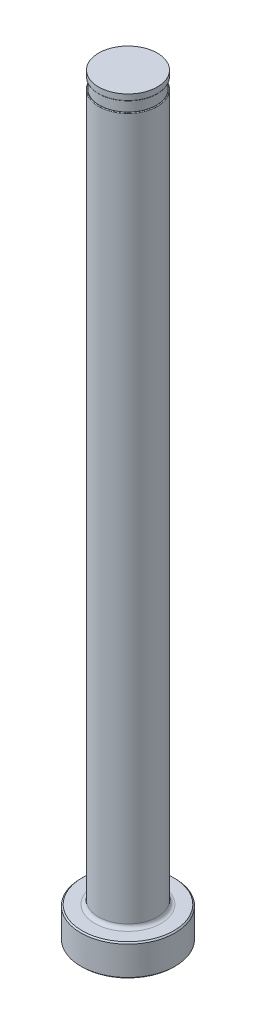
from build123d import *

# Parameters (mm, degrees)
CHAMFER1_SIZE     = 0.254
FILLET1_R         = 0.762
SKETCH2_W         = 0.2032
SKETCH2_H         = 2.032
D_SLOT_DEPTH      = 153.9941543
D_SLOT_DEPTH_BACK = 153.9941543
SKETCH5_W         = 0.0127
SKETCH5_H         = 1.27
FILLET2_R         = 0.127


with BuildPart() as part:
    # Sketch1 → Revolve1 (revolve)
    with BuildSketch(Plane.XY, mode=Mode.PRIVATE) as revolve1_sk:
        Polygon((0, 0), (-9.525, 0), (-9.525, 6.35), (-5.95249, 6.35), (-5.95249, 152.4), (0, 152.4), align=None)
    revolve(revolve1_sk.sketch.rotate(Axis((0, 259.958771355, 0), (0, -1, 0)), 270), axis=Axis((0, 259.958771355, 0), (0, -1, 0)))

    # Chamfer1
    chamfer1_edges = [part.edges().sort_by_distance(p)[0] for p in [
        (0, 6.35, -9.525),
        (0, 0, -9.525),
    ]]
    chamfer(chamfer1_edges, length=CHAMFER1_SIZE)

    # Fillet1
    fillet1_edges = [part.edges().sort_by_distance(p)[0] for p in [
        (0, 6.35, -5.95249),
    ]]
    fillet(fillet1_edges, radius=FILLET1_R)

    # Sketch2 → Vent Relief (revolve, cut)
    with BuildSketch(Plane.XY, mode=Mode.PRIVATE) as vent_relief_sk:
        with Locations((-5.85089, 150.114)):
            Rectangle(SKETCH2_W, SKETCH2_H)
    revolve(vent_relief_sk.sketch.rotate(Axis((0, 153.448281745, 0), (0, -1, 0)), 270), axis=Axis((0, 153.448281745, 0), (0, -1, 0)), mode=Mode.SUBTRACT)

    # Sketch3 → D-Slot (cut, two sides: drawn at the far end of the back side and taken through both)
    with BuildSketch(Plane.XY.offset(-D_SLOT_DEPTH_BACK)):
        with BuildLine():
            Line((-5.74929, 150.114), (-5.74929, 86.614))
            ThreePointArc((-5.74929, 86.614), (-5.800503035, 86.046038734), (-5.95249, 85.4964))
            Line((-5.95249, 85.4964), (-5.95249, 150.114))
            Line((-5.95249, 150.114), (-5.74929, 150.114))
        make_face()
    extrude(amount=D_SLOT_DEPTH + D_SLOT_DEPTH_BACK, mode=Mode.SUBTRACT)

    # Sketch5 → Vent Diameter (revolve, cut)
    with BuildSketch(Plane.XY, mode=Mode.PRIVATE) as vent_diameter_sk:
        with Locations((-5.94614, 151.765)):
            Rectangle(SKETCH5_W, SKETCH5_H)
    revolve(vent_diameter_sk.sketch.rotate(Axis((0, 152.687735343, 0), (0, -1, 0)), 90), axis=Axis((0, 152.687735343, 0), (0, -1, 0)), mode=Mode.SUBTRACT)

    # Fillet2
    fillet2_edges = [part.edges().sort_by_distance(p)[0] for p in [
        (4.722867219, 149.098, -3.623073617),
        (0, 151.13, 5.93979),
    ]]
    fillet(fillet2_edges, radius=FILLET2_R)


solid = part.part
